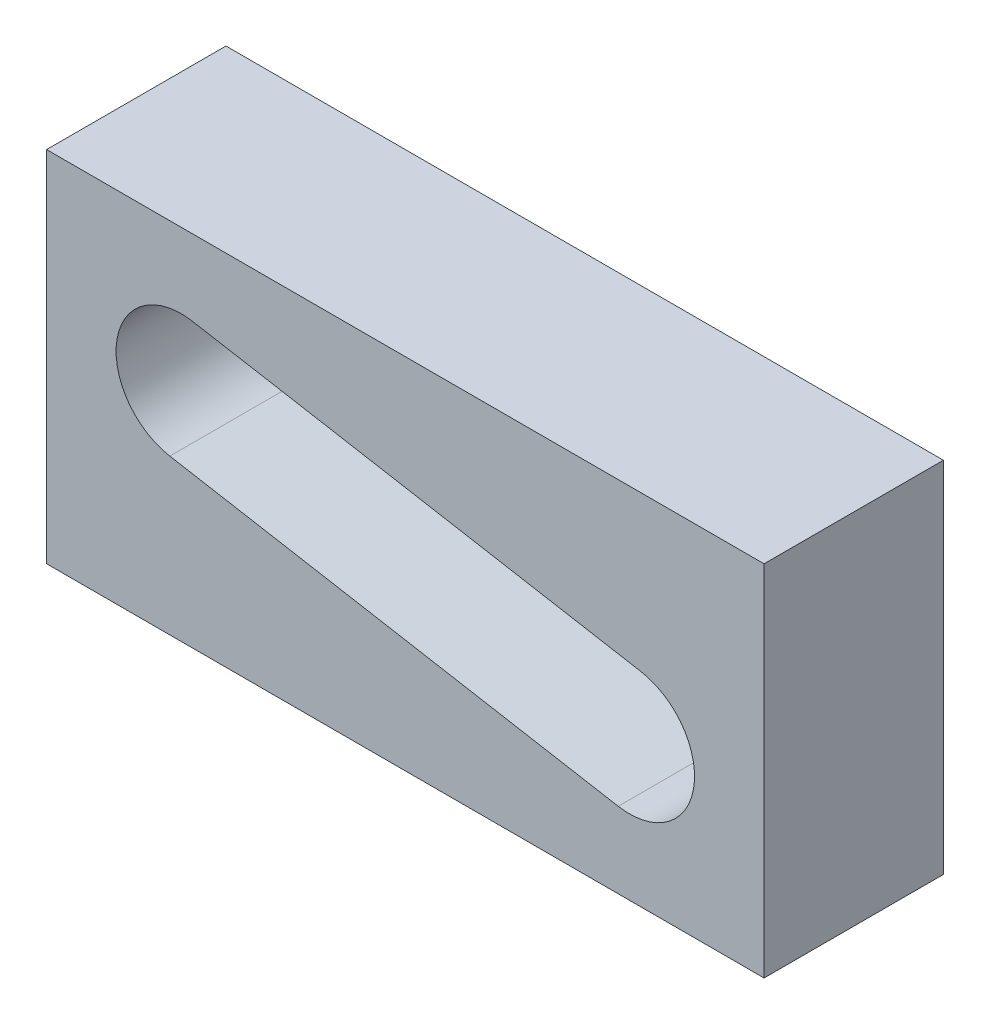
from build123d import *

# Parameters (mm, degrees)
SKETCH1_W           = 8
SKETCH1_H           = 4
BOSS_EXTRUDE1_DEPTH = 2


with BuildPart() as part:
    # Sketch1 → Boss-Extrude1 (new body)
    with BuildSketch(Plane.XY):
        with Locations((4, 2)):
            Rectangle(SKETCH1_W, SKETCH1_H)
        with BuildLine():
            Line((1.625894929, 3.154803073), (6.625894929, 2.273168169))
            ThreePointArc((6.625894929, 2.273168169), (7.213985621, 1.433287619), (6.374105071, 0.845196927))
            Line((6.374105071, 0.845196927), (1.374105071, 1.726831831))
            ThreePointArc((1.374105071, 1.726831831), (0.786014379, 2.566712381), (1.625894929, 3.154803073))
        make_face(mode=Mode.SUBTRACT)
    extrude(amount=BOSS_EXTRUDE1_DEPTH)


solid = part.part
